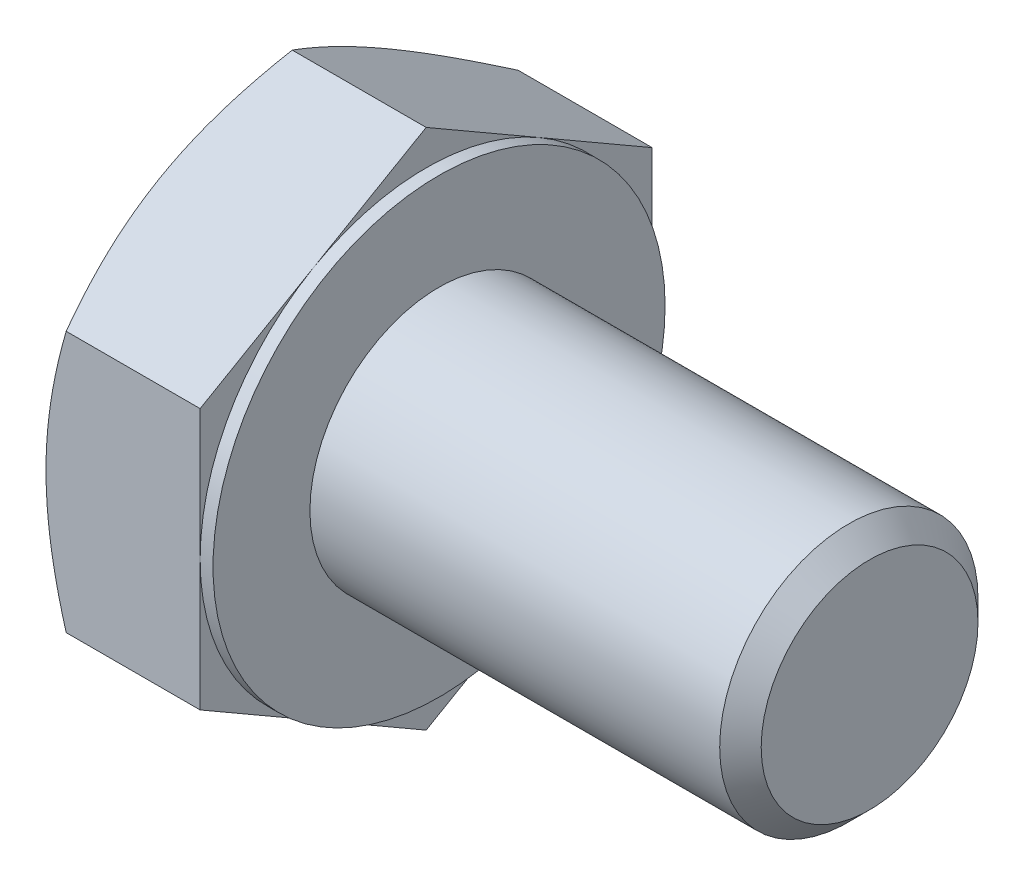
ISO-10303-21;
HEADER;
FILE_DESCRIPTION(('STEP AP214'),'2;1');
FILE_NAME('part.step','',(''),(''),'','','');
FILE_SCHEMA(('AUTOMOTIVE_DESIGN { 1 0 10303 214 1 1 1 1 }'));
ENDSEC;
DATA;
#1=APPLICATION_CONTEXT('core data for automotive mechanical design processes');
#2=APPLICATION_PROTOCOL_DEFINITION('international standard','automotive_design',2000,#1);
#3=PRODUCT_CONTEXT('',#1,'mechanical');
#4=PRODUCT('Part','Part','',(#3));
#5=PRODUCT_RELATED_PRODUCT_CATEGORY('part','',(#4));
#6=PRODUCT_DEFINITION_FORMATION('','',#4);
#7=PRODUCT_DEFINITION_CONTEXT('part definition',#1,'design');
#8=PRODUCT_DEFINITION('design','',#6,#7);
#9=PRODUCT_DEFINITION_SHAPE('','',#8);
#10=(LENGTH_UNIT() NAMED_UNIT(*) SI_UNIT(.MILLI.,.METRE.));
#11=(NAMED_UNIT(*) PLANE_ANGLE_UNIT() SI_UNIT($,.RADIAN.));
#12=(NAMED_UNIT(*) SI_UNIT($,.STERADIAN.) SOLID_ANGLE_UNIT());
#13=UNCERTAINTY_MEASURE_WITH_UNIT(LENGTH_MEASURE(1.E-05),#10,'distance_accuracy_value','');
#14=(GEOMETRIC_REPRESENTATION_CONTEXT(3) GLOBAL_UNCERTAINTY_ASSIGNED_CONTEXT((#13)) GLOBAL_UNIT_ASSIGNED_CONTEXT((#10,
#11,#12)) REPRESENTATION_CONTEXT('',''));
#15=CARTESIAN_POINT('',(0.,0.,0.));
#16=DIRECTION('',(0.,0.,1.));
#17=DIRECTION('',(1.,0.,0.));
#18=AXIS2_PLACEMENT_3D('',#15,#16,#17);
#19=CARTESIAN_POINT('',(7.76,12.1243556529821,0.));
#20=DIRECTION('',(1.,0.,0.));
#21=DIRECTION('',(0.,0.,-1.));
#22=AXIS2_PLACEMENT_3D('',#19,#20,#21);
#23=PLANE('',#22);
#24=CARTESIAN_POINT('',(7.76,0.,0.));
#25=DIRECTION('',(1.,0.,0.));
#26=DIRECTION('',(0.,0.,-1.));
#27=AXIS2_PLACEMENT_3D('',#24,#25,#26);
#28=CIRCLE('',#27,6.);
#29=CARTESIAN_POINT('',(7.76,0.,-6.));
#30=VERTEX_POINT('',#29);
#31=EDGE_CURVE('E254',#30,#30,#28,.F.);
#32=ORIENTED_EDGE('',*,*,#31,.T.);
#33=EDGE_LOOP('',(#32));
#34=FACE_BOUND('',#33,.T.);
#35=CARTESIAN_POINT('',(7.76,0.,0.));
#36=DIRECTION('',(1.,0.,0.));
#37=DIRECTION('',(0.,0.,-1.));
#38=AXIS2_PLACEMENT_3D('',#35,#36,#37);
#39=CIRCLE('',#38,10.5);
#40=CARTESIAN_POINT('',(7.76,0.,-10.5));
#41=VERTEX_POINT('',#40);
#42=EDGE_CURVE('E257',#41,#41,#39,.T.);
#43=ORIENTED_EDGE('',*,*,#42,.T.);
#44=EDGE_LOOP('',(#43));
#45=FACE_BOUND('',#44,.T.);
#46=ADVANCED_FACE('F35',(#34,#45),#23,.T.);
#47=CARTESIAN_POINT('',(0.,0.,0.));
#48=DIRECTION('',(-1.,0.,0.));
#49=DIRECTION('',(0.,0.,1.));
#50=AXIS2_PLACEMENT_3D('',#47,#48,#49);
#51=CYLINDRICAL_SURFACE('',#50,6.);
#52=ORIENTED_EDGE('',*,*,#31,.F.);
#53=EDGE_LOOP('',(#52));
#54=FACE_BOUND('',#53,.T.);
#55=CARTESIAN_POINT('',(26.796,0.,0.));
#56=DIRECTION('',(-1.,0.,0.));
#57=DIRECTION('',(0.,0.,1.));
#58=AXIS2_PLACEMENT_3D('',#55,#56,#57);
#59=CIRCLE('',#58,6.);
#60=CARTESIAN_POINT('',(26.796,0.,6.));
#61=VERTEX_POINT('',#60);
#62=EDGE_CURVE('E277',#61,#61,#59,.T.);
#63=ORIENTED_EDGE('',*,*,#62,.T.);
#64=EDGE_LOOP('',(#63));
#65=FACE_BOUND('',#64,.T.);
#66=ADVANCED_FACE('F243',(#54,#65),#51,.T.);
#67=CARTESIAN_POINT('',(27.76,0.,0.));
#68=DIRECTION('',(-1.,0.,0.));
#69=DIRECTION('',(0.,0.,1.));
#70=AXIS2_PLACEMENT_3D('',#67,#68,#69);
#71=CONICAL_SURFACE('',#70,5.036,0.785398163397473);
#72=ORIENTED_EDGE('',*,*,#62,.F.);
#73=EDGE_LOOP('',(#72));
#74=FACE_BOUND('',#73,.T.);
#75=CARTESIAN_POINT('',(27.76,0.,0.));
#76=DIRECTION('',(-1.,0.,0.));
#77=DIRECTION('',(0.,0.,1.));
#78=AXIS2_PLACEMENT_3D('',#75,#76,#77);
#79=CIRCLE('',#78,5.036);
#80=CARTESIAN_POINT('',(27.76,0.,5.036));
#81=VERTEX_POINT('',#80);
#82=EDGE_CURVE('E279',#81,#81,#79,.T.);
#83=ORIENTED_EDGE('',*,*,#82,.T.);
#84=EDGE_LOOP('',(#83));
#85=FACE_BOUND('',#84,.T.);
#86=ADVANCED_FACE('F248',(#74,#85),#71,.T.);
#87=CARTESIAN_POINT('',(27.76,0.,0.));
#88=DIRECTION('',(-1.,0.,0.));
#89=DIRECTION('',(0.,0.,1.));
#90=AXIS2_PLACEMENT_3D('',#87,#88,#89);
#91=PLANE('',#90);
#92=ORIENTED_EDGE('',*,*,#82,.F.);
#93=EDGE_LOOP('',(#92));
#94=FACE_BOUND('',#93,.T.);
#95=ADVANCED_FACE('F343',(#94),#91,.F.);
#96=CARTESIAN_POINT('',(7.16,10.5,0.));
#97=DIRECTION('',(1.,0.,0.));
#98=DIRECTION('',(0.,0.,-1.));
#99=AXIS2_PLACEMENT_3D('',#96,#97,#98);
#100=PLANE('',#99);
#101=DIRECTION('',(0.,0.500000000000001,0.866025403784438));
#102=VECTOR('',#101,1.);
#103=CARTESIAN_POINT('',(7.16,6.06217782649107,-10.5));
#104=LINE('',#103,#102);
#105=CARTESIAN_POINT('',(7.16,6.06217782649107,-10.5));
#106=VERTEX_POINT('',#105);
#107=CARTESIAN_POINT('',(7.16,9.0932667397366,-5.25000000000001));
#108=VERTEX_POINT('',#107);
#109=EDGE_CURVE('E168',#106,#108,#104,.T.);
#110=ORIENTED_EDGE('',*,*,#109,.T.);
#111=CARTESIAN_POINT('',(7.16,0.,0.));
#112=DIRECTION('',(-1.,0.,0.));
#113=DIRECTION('',(0.,0.,1.));
#114=AXIS2_PLACEMENT_3D('',#111,#112,#113);
#115=CIRCLE('',#114,10.5);
#116=CARTESIAN_POINT('',(7.16,0.,-10.5));
#117=VERTEX_POINT('',#116);
#118=EDGE_CURVE('E51',#108,#117,#115,.T.);
#119=ORIENTED_EDGE('',*,*,#118,.T.);
#120=DIRECTION('',(0.,1.,0.));
#121=VECTOR('',#120,1.);
#122=CARTESIAN_POINT('',(7.16,6.06217782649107,-10.5));
#123=LINE('',#122,#121);
#124=EDGE_CURVE('E40',#117,#106,#123,.T.);
#125=ORIENTED_EDGE('',*,*,#124,.T.);
#126=EDGE_LOOP('',(#110,#119,#125));
#127=FACE_BOUND('',#126,.T.);
#128=ADVANCED_FACE('F335',(#127),#100,.T.);
#129=CARTESIAN_POINT('',(7.16,12.1243556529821,0.));
#130=VERTEX_POINT('',#129);
#131=EDGE_CURVE('E166',#108,#130,#104,.T.);
#132=ORIENTED_EDGE('',*,*,#131,.T.);
#133=DIRECTION('',(0.,-0.500000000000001,0.866025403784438));
#134=VECTOR('',#133,1.);
#135=CARTESIAN_POINT('',(7.16,12.1243556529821,0.));
#136=LINE('',#135,#134);
#137=CARTESIAN_POINT('',(7.16,9.0932667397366,5.25000000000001));
#138=VERTEX_POINT('',#137);
#139=EDGE_CURVE('E165',#130,#138,#136,.T.);
#140=ORIENTED_EDGE('',*,*,#139,.T.);
#141=EDGE_CURVE('E154',#138,#108,#115,.T.);
#142=ORIENTED_EDGE('',*,*,#141,.T.);
#143=EDGE_LOOP('',(#132,#140,#142));
#144=FACE_BOUND('',#143,.T.);
#145=ADVANCED_FACE('F337',(#144),#100,.T.);
#146=CARTESIAN_POINT('',(7.16,6.06217782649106,10.5));
#147=VERTEX_POINT('',#146);
#148=EDGE_CURVE('E133',#138,#147,#136,.T.);
#149=ORIENTED_EDGE('',*,*,#148,.T.);
#150=DIRECTION('',(0.,-1.,0.));
#151=VECTOR('',#150,1.);
#152=CARTESIAN_POINT('',(7.16,6.06217782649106,10.5));
#153=LINE('',#152,#151);
#154=CARTESIAN_POINT('',(7.16,0.,10.5));
#155=VERTEX_POINT('',#154);
#156=EDGE_CURVE('E127',#147,#155,#153,.T.);
#157=ORIENTED_EDGE('',*,*,#156,.T.);
#158=EDGE_CURVE('E131',#155,#138,#115,.T.);
#159=ORIENTED_EDGE('',*,*,#158,.T.);
#160=EDGE_LOOP('',(#149,#157,#159));
#161=FACE_BOUND('',#160,.T.);
#162=ADVANCED_FACE('F129',(#161),#100,.T.);
#163=CARTESIAN_POINT('',(7.16,-6.06217782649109,10.5));
#164=VERTEX_POINT('',#163);
#165=EDGE_CURVE('E137',#155,#164,#153,.T.);
#166=ORIENTED_EDGE('',*,*,#165,.T.);
#167=DIRECTION('',(0.,-0.500000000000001,-0.866025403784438));
#168=VECTOR('',#167,1.);
#169=CARTESIAN_POINT('',(7.16,-12.1243556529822,0.));
#170=LINE('',#169,#168);
#171=CARTESIAN_POINT('',(7.16,-9.0932667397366,5.25000000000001));
#172=VERTEX_POINT('',#171);
#173=EDGE_CURVE('E144',#164,#172,#170,.T.);
#174=ORIENTED_EDGE('',*,*,#173,.T.);
#175=EDGE_CURVE('E141',#172,#155,#115,.T.);
#176=ORIENTED_EDGE('',*,*,#175,.T.);
#177=EDGE_LOOP('',(#166,#174,#176));
#178=FACE_BOUND('',#177,.T.);
#179=ADVANCED_FACE('F142',(#178),#100,.T.);
#180=CARTESIAN_POINT('',(7.16,-12.1243556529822,0.));
#181=VERTEX_POINT('',#180);
#182=EDGE_CURVE('E160',#172,#181,#170,.T.);
#183=ORIENTED_EDGE('',*,*,#182,.T.);
#184=DIRECTION('',(0.,0.500000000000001,-0.866025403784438));
#185=VECTOR('',#184,1.);
#186=CARTESIAN_POINT('',(7.16,-6.06217782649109,-10.5));
#187=LINE('',#186,#185);
#188=CARTESIAN_POINT('',(7.16,-9.0932667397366,-5.25000000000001));
#189=VERTEX_POINT('',#188);
#190=EDGE_CURVE('E329',#181,#189,#187,.T.);
#191=ORIENTED_EDGE('',*,*,#190,.T.);
#192=EDGE_CURVE('E148',#189,#172,#115,.T.);
#193=ORIENTED_EDGE('',*,*,#192,.T.);
#194=EDGE_LOOP('',(#183,#191,#193));
#195=FACE_BOUND('',#194,.T.);
#196=ADVANCED_FACE('F350',(#195),#100,.T.);
#197=CARTESIAN_POINT('',(7.16,-6.06217782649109,-10.5));
#198=VERTEX_POINT('',#197);
#199=EDGE_CURVE('E155',#189,#198,#187,.T.);
#200=ORIENTED_EDGE('',*,*,#199,.T.);
#201=EDGE_CURVE('E11',#198,#117,#123,.T.);
#202=ORIENTED_EDGE('',*,*,#201,.T.);
#203=EDGE_CURVE('E334',#117,#189,#115,.T.);
#204=ORIENTED_EDGE('',*,*,#203,.T.);
#205=EDGE_LOOP('',(#200,#202,#204));
#206=FACE_BOUND('',#205,.T.);
#207=ADVANCED_FACE('F332',(#206),#100,.T.);
#208=CARTESIAN_POINT('',(0.,0.,0.));
#209=DIRECTION('',(-1.,0.,0.));
#210=DIRECTION('',(0.,0.,1.));
#211=AXIS2_PLACEMENT_3D('',#208,#209,#210);
#212=CYLINDRICAL_SURFACE('',#211,10.5);
#213=ORIENTED_EDGE('',*,*,#118,.F.);
#214=ORIENTED_EDGE('',*,*,#141,.F.);
#215=ORIENTED_EDGE('',*,*,#158,.F.);
#216=ORIENTED_EDGE('',*,*,#175,.F.);
#217=ORIENTED_EDGE('',*,*,#192,.F.);
#218=ORIENTED_EDGE('',*,*,#203,.F.);
#219=EDGE_LOOP('',(#213,#214,#215,#216,#217,#218));
#220=FACE_BOUND('',#219,.T.);
#221=ORIENTED_EDGE('',*,*,#42,.F.);
#222=EDGE_LOOP('',(#221));
#223=FACE_BOUND('',#222,.T.);
#224=ADVANCED_FACE('F151',(#220,#223),#212,.T.);
#225=CARTESIAN_POINT('',(0.,12.1243556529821,0.));
#226=DIRECTION('',(1.,0.,0.));
#227=DIRECTION('',(0.,0.,-1.));
#228=AXIS2_PLACEMENT_3D('',#225,#226,#227);
#229=PLANE('',#228);
#230=CARTESIAN_POINT('',(0.,0.,0.));
#231=DIRECTION('',(1.,0.,0.));
#232=DIRECTION('',(0.,0.,-1.));
#233=AXIS2_PLACEMENT_3D('',#230,#231,#232);
#234=CIRCLE('',#233,10.5);
#235=CARTESIAN_POINT('',(0.,0.,-10.5));
#236=VERTEX_POINT('',#235);
#237=CARTESIAN_POINT('',(0.,9.0932667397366,-5.25000000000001));
#238=VERTEX_POINT('',#237);
#239=EDGE_CURVE('E258',#236,#238,#234,.T.);
#240=ORIENTED_EDGE('',*,*,#239,.F.);
#241=CARTESIAN_POINT('',(0.,-9.0932667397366,-5.25000000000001));
#242=VERTEX_POINT('',#241);
#243=EDGE_CURVE('E261',#242,#236,#234,.T.);
#244=ORIENTED_EDGE('',*,*,#243,.F.);
#245=CARTESIAN_POINT('',(0.,-9.0932667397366,5.25000000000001));
#246=VERTEX_POINT('',#245);
#247=EDGE_CURVE('E264',#246,#242,#234,.T.);
#248=ORIENTED_EDGE('',*,*,#247,.F.);
#249=CARTESIAN_POINT('',(0.,0.,10.5));
#250=VERTEX_POINT('',#249);
#251=EDGE_CURVE('E300',#250,#246,#234,.T.);
#252=ORIENTED_EDGE('',*,*,#251,.F.);
#253=CARTESIAN_POINT('',(0.,0.,0.));
#254=DIRECTION('',(-1.,0.,0.));
#255=DIRECTION('',(0.,0.,1.));
#256=AXIS2_PLACEMENT_3D('',#253,#254,#255);
#257=CIRCLE('',#256,10.5);
#258=CARTESIAN_POINT('',(0.,9.0932667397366,5.25000000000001));
#259=VERTEX_POINT('',#258);
#260=EDGE_CURVE('E169',#250,#259,#257,.T.);
#261=ORIENTED_EDGE('',*,*,#260,.T.);
#262=EDGE_CURVE('E259',#238,#259,#234,.T.);
#263=ORIENTED_EDGE('',*,*,#262,.F.);
#264=EDGE_LOOP('',(#240,#244,#248,#252,#261,#263));
#265=FACE_BOUND('',#264,.T.);
#266=ADVANCED_FACE('F301',(#265),#229,.F.);
#267=CARTESIAN_POINT('',(0.,0.,0.));
#268=DIRECTION('',(1.,0.,0.));
#269=DIRECTION('',(0.,0.,-1.));
#270=AXIS2_PLACEMENT_3D('',#267,#268,#269);
#271=CONICAL_SURFACE('',#270,10.5,1.0471975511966);
#272=CARTESIAN_POINT('',(0.937888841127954,6.06206235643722,10.5002));
#273=CARTESIAN_POINT('',(0.860963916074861,6.19532217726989,10.2693872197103));
#274=CARTESIAN_POINT('',(0.787530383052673,6.32907886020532,10.0377138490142));
#275=CARTESIAN_POINT('',(0.648614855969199,6.5976648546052,9.57250926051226));
#276=CARTESIAN_POINT('',(0.583135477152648,6.7324945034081,9.33897745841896));
#277=CARTESIAN_POINT('',(0.399895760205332,7.13915595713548,8.63461915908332));
#278=CARTESIAN_POINT('',(0.295669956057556,7.41259311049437,8.16101211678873));
#279=CARTESIAN_POINT('',(0.173455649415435,7.82177929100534,7.45228086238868));
#280=CARTESIAN_POINT('',(0.138641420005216,7.95630585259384,7.21927402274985));
#281=CARTESIAN_POINT('',(0.0802602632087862,8.22598182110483,6.75218154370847));
#282=CARTESIAN_POINT('',(0.0566935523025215,8.36113123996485,6.51809588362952));
#283=CARTESIAN_POINT('',(0.0214112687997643,8.63165551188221,6.04953409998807));
#284=CARTESIAN_POINT('',(0.00968161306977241,8.76702990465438,5.81505877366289));
#285=CARTESIAN_POINT('',(-0.00167731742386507,9.03790372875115,5.34589154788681));
#286=CARTESIAN_POINT('',(-0.00130696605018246,9.17340315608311,5.11119965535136));
#287=CARTESIAN_POINT('',(0.0106922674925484,9.42672188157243,4.67243875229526));
#288=CARTESIAN_POINT('',(0.0208573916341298,9.54455906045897,4.4683387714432));
#289=CARTESIAN_POINT('',(0.0501416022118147,9.77995782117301,4.06061615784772));
#290=CARTESIAN_POINT('',(0.0692613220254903,9.89751938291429,3.85699355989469));
#291=CARTESIAN_POINT('',(0.139600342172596,10.2497485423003,3.24691475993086));
#292=CARTESIAN_POINT('',(0.203790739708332,10.4837926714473,2.84153843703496));
#293=CARTESIAN_POINT('',(0.364267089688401,10.9543635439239,2.02648577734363));
#294=CARTESIAN_POINT('',(0.461233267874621,11.1908302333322,1.61691345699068));
#295=CARTESIAN_POINT('',(0.681306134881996,11.6602373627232,0.80387645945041));
#296=CARTESIAN_POINT('',(0.804361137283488,11.8931838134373,0.40040137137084));
#297=CARTESIAN_POINT('',(0.937888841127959,12.124471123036,-0.000199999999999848));
#298=B_SPLINE_CURVE_WITH_KNOTS('',3,(#272,#273,#274,#275,#276,#277,#278,#279,#280,#281,#282,
#283,#284,#285,#286,#287,#288,#289,#290,#291,#292,#293,#294,#295,#296,#297),.UNSPECIFIED.,.F.,
.F.,(4,2,2,2,2,2,2,2,2,2,2,2,4),(0.,0.832130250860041,1.66453336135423,3.33288308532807,
4.14658222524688,4.9602970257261,5.77304256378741,6.5857629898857,7.29326708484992,
8.00082123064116,9.41693497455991,10.864454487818,12.3091325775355),.UNSPECIFIED.);
#299=CARTESIAN_POINT('',(0.93782217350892,12.1243556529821,0.));
#300=VERTEX_POINT('',#299);
#301=EDGE_CURVE('E215',#259,#300,#298,.T.);
#302=ORIENTED_EDGE('',*,*,#301,.T.);
#303=CARTESIAN_POINT('',(0.93788884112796,12.124471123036,0.0002));
#304=CARTESIAN_POINT('',(0.860963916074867,11.9912113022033,-0.230612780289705));
#305=CARTESIAN_POINT('',(0.787530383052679,11.8574546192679,-0.462286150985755));
#306=CARTESIAN_POINT('',(0.648614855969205,11.588868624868,-0.927490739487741));
#307=CARTESIAN_POINT('',(0.583135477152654,11.4540389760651,-1.16102254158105));
#308=CARTESIAN_POINT('',(0.399895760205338,11.0473775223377,-1.86538084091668));
#309=CARTESIAN_POINT('',(0.295669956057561,10.7739403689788,-2.33898788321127));
#310=CARTESIAN_POINT('',(0.173455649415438,10.3647541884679,-3.04771913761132));
#311=CARTESIAN_POINT('',(0.138641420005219,10.2302276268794,-3.28072597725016));
#312=CARTESIAN_POINT('',(0.0802602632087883,9.96055165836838,-3.74781845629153));
#313=CARTESIAN_POINT('',(0.0566935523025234,9.82540223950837,-3.98190411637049));
#314=CARTESIAN_POINT('',(0.0214112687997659,9.554877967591,-4.45046590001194));
#315=CARTESIAN_POINT('',(0.00968161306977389,9.41950357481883,-4.68494122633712));
#316=CARTESIAN_POINT('',(-0.00167731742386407,9.14862975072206,-5.1541084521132));
#317=CARTESIAN_POINT('',(-0.00130696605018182,9.0131303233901,-5.38880034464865));
#318=CARTESIAN_POINT('',(0.0106922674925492,8.75981159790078,-5.82756124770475));
#319=CARTESIAN_POINT('',(0.0208573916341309,8.64197441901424,-6.03166122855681));
#320=CARTESIAN_POINT('',(0.0501416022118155,8.4065756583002,-6.43938384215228));
#321=CARTESIAN_POINT('',(0.0692613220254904,8.28901409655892,-6.64300644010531));
#322=CARTESIAN_POINT('',(0.139600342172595,7.93678493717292,-7.25308524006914));
#323=CARTESIAN_POINT('',(0.20379073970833,7.70274080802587,-7.65846156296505));
#324=CARTESIAN_POINT('',(0.364267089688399,7.23216993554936,-8.47351422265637));
#325=CARTESIAN_POINT('',(0.461233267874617,6.99570324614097,-8.88308654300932));
#326=CARTESIAN_POINT('',(0.681306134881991,6.52629611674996,-9.69612354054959));
#327=CARTESIAN_POINT('',(0.804361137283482,6.29334966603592,-10.0995986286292));
#328=CARTESIAN_POINT('',(0.937888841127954,6.06206235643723,-10.5002));
#329=B_SPLINE_CURVE_WITH_KNOTS('',3,(#303,#304,#305,#306,#307,#308,#309,#310,#311,#312,#313,
#314,#315,#316,#317,#318,#319,#320,#321,#322,#323,#324,#325,#326,#327,#328),.UNSPECIFIED.,.F.,
.F.,(4,2,2,2,2,2,2,2,2,2,2,2,4),(0.,0.83213025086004,1.66453336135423,3.33288308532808,
4.14658222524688,4.9602970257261,5.77304256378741,6.58576298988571,7.29326708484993,
8.00082123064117,9.41693497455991,10.864454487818,12.3091325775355),.UNSPECIFIED.);
#330=EDGE_CURVE('E59',#300,#238,#329,.T.);
#331=ORIENTED_EDGE('',*,*,#330,.T.);
#332=ORIENTED_EDGE('',*,*,#262,.T.);
#333=EDGE_LOOP('',(#302,#331,#332));
#334=FACE_BOUND('',#333,.T.);
#335=ADVANCED_FACE('F297',(#334),#271,.T.);
#336=CARTESIAN_POINT('',(5.22047445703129,-16.4816482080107,10.5));
#337=CARTESIAN_POINT('',(5.10841570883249,-16.2515114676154,10.5));
#338=CARTESIAN_POINT('',(4.99690095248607,-16.0211099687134,10.5));
#339=CARTESIAN_POINT('',(4.77508224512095,-15.5597222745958,10.5));
#340=CARTESIAN_POINT('',(4.66477830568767,-15.3287360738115,10.5));
#341=CARTESIAN_POINT('',(4.33583913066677,-14.6347588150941,10.5));
#342=CARTESIAN_POINT('',(4.11920831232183,-14.170814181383,10.5));
#343=CARTESIAN_POINT('',(3.69144021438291,-13.23745423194,10.5));
#344=CARTESIAN_POINT('',(3.48033759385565,-12.768022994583,10.5));
#345=CARTESIAN_POINT('',(3.06650722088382,-11.8254960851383,10.5));
#346=CARTESIAN_POINT('',(2.86377908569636,-11.3524005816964,10.5));
#347=CARTESIAN_POINT('',(2.46224554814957,-10.3857558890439,10.5));
#348=CARTESIAN_POINT('',(2.26380321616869,-9.8920551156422,10.5));
#349=CARTESIAN_POINT('',(1.88146297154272,-8.89894763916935,10.5));
#350=CARTESIAN_POINT('',(1.69756666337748,-8.39954031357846,10.5));
#351=CARTESIAN_POINT('',(1.34900485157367,-7.39511365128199,10.5));
#352=CARTESIAN_POINT('',(1.1843020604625,-6.89010735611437,10.5));
#353=CARTESIAN_POINT('',(0.87927089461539,-5.87280589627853,10.5));
#354=CARTESIAN_POINT('',(0.738935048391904,-5.3605130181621,10.5));
#355=CARTESIAN_POINT('',(0.552073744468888,-4.58793726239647,10.5));
#356=CARTESIAN_POINT('',(0.49386024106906,-4.33046551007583,10.5));
#357=CARTESIAN_POINT('',(0.385986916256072,-3.81372703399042,10.5));
#358=CARTESIAN_POINT('',(0.336326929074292,-3.55446034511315,10.5));
#359=CARTESIAN_POINT('',(0.246424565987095,-3.03429646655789,10.5));
#360=CARTESIAN_POINT('',(0.206181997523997,-2.77339931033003,10.5));
#361=CARTESIAN_POINT('',(0.135909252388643,-2.25023434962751,10.5));
#362=CARTESIAN_POINT('',(0.105878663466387,-1.98796660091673,10.5));
#363=CARTESIAN_POINT('',(0.0570143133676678,-1.46593685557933,10.5));
#364=CARTESIAN_POINT('',(0.0380355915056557,-1.20618851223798,10.5));
#365=CARTESIAN_POINT('',(0.0110886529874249,-0.686121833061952,10.5));
#366=CARTESIAN_POINT('',(0.00312024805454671,-0.425803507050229,10.5));
#367=CARTESIAN_POINT('',(-0.00161548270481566,0.0949369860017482,10.5));
#368=CARTESIAN_POINT('',(0.00161717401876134,0.355359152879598,10.5));
#369=CARTESIAN_POINT('',(0.0192021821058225,0.875830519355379,10.5));
#370=CARTESIAN_POINT('',(0.033555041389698,1.13587970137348,10.5));
#371=CARTESIAN_POINT('',(0.0806524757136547,1.75496707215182,10.5));
#372=CARTESIAN_POINT('',(0.118345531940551,2.11363730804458,10.5));
#373=CARTESIAN_POINT('',(0.212873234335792,2.82842727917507,10.5));
#374=CARTESIAN_POINT('',(0.269710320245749,3.18454668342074,10.5));
#375=CARTESIAN_POINT('',(0.465933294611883,4.24861013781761,10.5));
#376=CARTESIAN_POINT('',(0.630998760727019,4.95188759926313,10.5));
#377=CARTESIAN_POINT('',(0.918660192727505,6.00372345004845,10.5));
#378=CARTESIAN_POINT('',(1.02259898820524,6.35769943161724,10.5));
#379=CARTESIAN_POINT('',(1.24163072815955,7.06221736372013,10.5));
#380=CARTESIAN_POINT('',(1.35672375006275,7.41275929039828,10.5));
#381=CARTESIAN_POINT('',(1.59618779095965,8.11051221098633,10.5));
#382=CARTESIAN_POINT('',(1.72055601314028,8.45772417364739,10.5));
#383=CARTESIAN_POINT('',(1.97707155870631,9.14924772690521,10.5));
#384=CARTESIAN_POINT('',(2.1092187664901,9.49355936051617,10.5));
#385=CARTESIAN_POINT('',(2.44296998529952,10.3391183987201,10.5));
#386=CARTESIAN_POINT('',(2.64829832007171,10.8388934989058,10.5));
#387=CARTESIAN_POINT('',(3.06975629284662,11.8338833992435,10.5));
#388=CARTESIAN_POINT('',(3.2858867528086,12.3290978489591,10.5));
#389=CARTESIAN_POINT('',(3.72667155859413,13.3158710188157,10.5));
#390=CARTESIAN_POINT('',(3.95132823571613,13.8074286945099,10.5));
#391=CARTESIAN_POINT('',(4.40735039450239,14.7873974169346,10.5));
#392=CARTESIAN_POINT('',(4.63871569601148,15.2758085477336,10.5));
#393=CARTESIAN_POINT('',(5.10713603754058,16.2506551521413,10.5));
#394=CARTESIAN_POINT('',(5.3441979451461,16.7370873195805,10.5));
#395=CARTESIAN_POINT('',(5.82271335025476,17.7077867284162,10.5));
#396=CARTESIAN_POINT('',(6.06416687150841,18.1920539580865,10.5));
#397=CARTESIAN_POINT('',(6.55064005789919,19.1586956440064,10.5));
#398=CARTESIAN_POINT('',(6.79565915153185,19.6410703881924,10.5));
#399=CARTESIAN_POINT('',(7.28869162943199,20.6042880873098,10.5));
#400=CARTESIAN_POINT('',(7.53670502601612,21.0851310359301,10.5));
#401=CARTESIAN_POINT('',(8.23932372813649,22.4387066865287,10.5));
#402=CARTESIAN_POINT('',(8.69680932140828,23.3099441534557,10.5));
#403=CARTESIAN_POINT('',(9.61789414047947,25.0492220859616,10.5));
#404=CARTESIAN_POINT('',(10.0814936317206,25.9172624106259,10.5));
#405=CARTESIAN_POINT('',(11.0120158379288,27.6483953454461,10.5));
#406=CARTESIAN_POINT('',(11.4789254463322,28.5114950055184,10.5));
#407=CARTESIAN_POINT('',(12.1819662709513,29.8046525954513,10.5));
#408=CARTESIAN_POINT('',(12.4167519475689,30.2354431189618,10.5));
#409=CARTESIAN_POINT('',(12.8871248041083,31.0965855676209,10.5));
#410=CARTESIAN_POINT('',(13.1227119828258,31.5269374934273,10.5));
#411=CARTESIAN_POINT('',(13.3586525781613,31.9570956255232,10.5));
#412=B_SPLINE_CURVE_WITH_KNOTS('',3,(#336,#337,#338,#339,#340,#341,#342,#343,#344,#345,#346,
#347,#348,#349,#350,#351,#352,#353,#354,#355,#356,#357,#358,#359,#360,#361,#362,#363,#364,#365,
#366,#367,#368,#369,#370,#371,#372,#373,#374,#375,#376,#377,#378,#379,#380,#381,#382,#383,#384,
#385,#386,#387,#388,#389,#390,#391,#392,#393,#394,#395,#396,#397,#398,#399,#400,#401,#402,#403,
#404,#405,#406,#407,#408,#409,#410,#411),.UNSPECIFIED.,.F.,.F.,(4,2,2,2,2,2,2,2,2,2,2,2,2,2,2,2,
2,2,2,2,2,2,2,2,2,2,2,2,2,2,2,2,2,2,2,2,2,4),(0.,0.767905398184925,1.53581813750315,
3.07186087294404,4.61593758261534,6.15994364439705,7.756038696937,9.35230955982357,
10.9454257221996,12.5380525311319,13.3298454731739,14.1216230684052,14.9133844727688,
15.7051139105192,16.4862101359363,17.2672930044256,18.04837465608,18.8294919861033,
19.9108211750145,20.9922882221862,23.1563369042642,24.2630005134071,25.3696718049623,
26.4760107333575,27.5823332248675,29.2030865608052,30.8239634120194,32.4452866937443,
34.0665664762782,35.6899099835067,37.3132622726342,38.936357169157,40.5594587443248,
43.5115615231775,46.4637928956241,49.407674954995,50.879524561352,52.3513719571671),.UNSPECIFIED.);
#413=CARTESIAN_POINT('',(0.937822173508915,6.06217782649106,10.5));
#414=VERTEX_POINT('',#413);
#415=EDGE_CURVE('E227',#250,#414,#412,.T.);
#416=ORIENTED_EDGE('',*,*,#415,.T.);
#417=EDGE_CURVE('E226',#414,#259,#298,.T.);
#418=ORIENTED_EDGE('',*,*,#417,.T.);
#419=ORIENTED_EDGE('',*,*,#260,.F.);
#420=EDGE_LOOP('',(#416,#418,#419));
#421=FACE_BOUND('',#420,.T.);
#422=ADVANCED_FACE('F293',(#421),#271,.T.);
#423=CARTESIAN_POINT('',(0.937822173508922,-6.06217782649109,10.5));
#424=VERTEX_POINT('',#423);
#425=EDGE_CURVE('E281',#424,#250,#412,.T.);
#426=ORIENTED_EDGE('',*,*,#425,.T.);
#427=ORIENTED_EDGE('',*,*,#251,.T.);
#428=CARTESIAN_POINT('',(0.937888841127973,-12.124471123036,-0.000199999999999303));
#429=CARTESIAN_POINT('',(0.860963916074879,-11.9912113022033,0.230612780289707));
#430=CARTESIAN_POINT('',(0.787530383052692,-11.8574546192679,0.462286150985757));
#431=CARTESIAN_POINT('',(0.648614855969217,-11.588868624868,0.927490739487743));
#432=CARTESIAN_POINT('',(0.583135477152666,-11.4540389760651,1.16102254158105));
#433=CARTESIAN_POINT('',(0.399895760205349,-11.0473775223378,1.86538084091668));
#434=CARTESIAN_POINT('',(0.295669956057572,-10.7739403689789,2.33898788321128));
#435=CARTESIAN_POINT('',(0.173455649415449,-10.3647541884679,3.04771913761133));
#436=CARTESIAN_POINT('',(0.13864142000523,-10.2302276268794,3.28072597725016));
#437=CARTESIAN_POINT('',(0.0802602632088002,-9.9605516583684,3.74781845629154));
#438=CARTESIAN_POINT('',(0.0566935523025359,-9.82540223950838,3.9819041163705));
#439=CARTESIAN_POINT('',(0.0214112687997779,-9.55487796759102,4.45046590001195));
#440=CARTESIAN_POINT('',(0.0096816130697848,-9.41950357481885,4.68494122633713));
#441=CARTESIAN_POINT('',(-0.00167731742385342,-9.14862975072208,5.15410845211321));
#442=CARTESIAN_POINT('',(-0.00130696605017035,-9.01313032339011,5.38880034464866));
#443=CARTESIAN_POINT('',(0.0106922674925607,-8.75981159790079,5.82756124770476));
#444=CARTESIAN_POINT('',(0.0208573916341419,-8.64197441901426,6.03166122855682));
#445=CARTESIAN_POINT('',(0.0501416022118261,-8.40657565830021,6.43938384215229));
#446=CARTESIAN_POINT('',(0.0692613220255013,-8.28901409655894,6.64300644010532));
#447=CARTESIAN_POINT('',(0.139600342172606,-7.93678493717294,7.25308524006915));
#448=CARTESIAN_POINT('',(0.203790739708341,-7.70274080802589,7.65846156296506));
#449=CARTESIAN_POINT('',(0.364267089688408,-7.23216993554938,8.47351422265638));
#450=CARTESIAN_POINT('',(0.461233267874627,-6.99570324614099,8.88308654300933));
#451=CARTESIAN_POINT('',(0.681306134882,-6.52629611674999,9.69612354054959));
#452=CARTESIAN_POINT('',(0.804361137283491,-6.29334966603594,10.0995986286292));
#453=CARTESIAN_POINT('',(0.937888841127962,-6.06206235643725,10.5002));
#454=B_SPLINE_CURVE_WITH_KNOTS('',3,(#428,#429,#430,#431,#432,#433,#434,#435,#436,#437,#438,
#439,#440,#441,#442,#443,#444,#445,#446,#447,#448,#449,#450,#451,#452,#453),.UNSPECIFIED.,.F.,
.F.,(4,2,2,2,2,2,2,2,2,2,2,2,4),(0.,0.832130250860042,1.66453336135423,3.33288308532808,
4.14658222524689,4.96029702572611,5.77304256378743,6.58576298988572,7.29326708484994,
8.00082123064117,9.41693497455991,10.864454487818,12.3091325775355),.UNSPECIFIED.);
#455=EDGE_CURVE('E217',#246,#424,#454,.T.);
#456=ORIENTED_EDGE('',*,*,#455,.T.);
#457=EDGE_LOOP('',(#426,#427,#456));
#458=FACE_BOUND('',#457,.T.);
#459=ADVANCED_FACE('F187',(#458),#271,.T.);
#460=CARTESIAN_POINT('',(0.937822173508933,-12.1243556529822,0.));
#461=VERTEX_POINT('',#460);
#462=EDGE_CURVE('E210',#461,#246,#454,.T.);
#463=ORIENTED_EDGE('',*,*,#462,.T.);
#464=ORIENTED_EDGE('',*,*,#247,.T.);
#465=CARTESIAN_POINT('',(0.937888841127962,-6.06206235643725,-10.5002));
#466=CARTESIAN_POINT('',(0.860963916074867,-6.19532217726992,-10.2693872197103));
#467=CARTESIAN_POINT('',(0.78753038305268,-6.32907886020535,-10.0377138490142));
#468=CARTESIAN_POINT('',(0.648614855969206,-6.59766485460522,-9.57250926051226));
#469=CARTESIAN_POINT('',(0.583135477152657,-6.73249450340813,-9.33897745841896));
#470=CARTESIAN_POINT('',(0.399895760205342,-7.13915595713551,-8.63461915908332));
#471=CARTESIAN_POINT('',(0.295669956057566,-7.41259311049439,-8.16101211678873));
#472=CARTESIAN_POINT('',(0.173455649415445,-7.82177929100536,-7.45228086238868));
#473=CARTESIAN_POINT('',(0.138641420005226,-7.95630585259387,-7.21927402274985));
#474=CARTESIAN_POINT('',(0.0802602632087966,-8.22598182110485,-6.75218154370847));
#475=CARTESIAN_POINT('',(0.0566935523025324,-8.36113123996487,-6.51809588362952));
#476=CARTESIAN_POINT('',(0.0214112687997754,-8.63165551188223,-6.04953409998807));
#477=CARTESIAN_POINT('',(0.00968161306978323,-8.7670299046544,-5.81505877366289));
#478=CARTESIAN_POINT('',(-0.00167731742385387,-9.03790372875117,-5.3458915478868));
#479=CARTESIAN_POINT('',(-0.00130696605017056,-9.17340315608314,-5.11119965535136));
#480=CARTESIAN_POINT('',(0.0106922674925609,-9.42672188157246,-4.67243875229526));
#481=CARTESIAN_POINT('',(0.0208573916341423,-9.544559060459,-4.46833877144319));
#482=CARTESIAN_POINT('',(0.0501416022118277,-9.77995782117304,-4.06061615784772));
#483=CARTESIAN_POINT('',(0.0692613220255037,-9.89751938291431,-3.85699355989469));
#484=CARTESIAN_POINT('',(0.13960034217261,-10.2497485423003,-3.24691475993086));
#485=CARTESIAN_POINT('',(0.203790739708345,-10.4837926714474,-2.84153843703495));
#486=CARTESIAN_POINT('',(0.364267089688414,-10.9543635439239,-2.02648577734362));
#487=CARTESIAN_POINT('',(0.461233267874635,-11.1908302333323,-1.61691345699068));
#488=CARTESIAN_POINT('',(0.68130613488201,-11.6602373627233,-0.803876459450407));
#489=CARTESIAN_POINT('',(0.804361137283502,-11.8931838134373,-0.400401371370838));
#490=CARTESIAN_POINT('',(0.937888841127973,-12.124471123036,0.000200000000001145));
#491=B_SPLINE_CURVE_WITH_KNOTS('',3,(#465,#466,#467,#468,#469,#470,#471,#472,#473,#474,#475,
#476,#477,#478,#479,#480,#481,#482,#483,#484,#485,#486,#487,#488,#489,#490),.UNSPECIFIED.,.F.,
.F.,(4,2,2,2,2,2,2,2,2,2,2,2,4),(0.,0.832130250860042,1.66453336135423,3.33288308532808,
4.14658222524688,4.9602970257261,5.77304256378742,6.58576298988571,7.29326708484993,
8.00082123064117,9.41693497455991,10.864454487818,12.3091325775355),.UNSPECIFIED.);
#492=EDGE_CURVE('E216',#242,#461,#491,.T.);
#493=ORIENTED_EDGE('',*,*,#492,.T.);
#494=EDGE_LOOP('',(#463,#464,#493));
#495=FACE_BOUND('',#494,.T.);
#496=ADVANCED_FACE('F326',(#495),#271,.T.);
#497=CARTESIAN_POINT('',(0.937822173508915,6.06217782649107,-10.5));
#498=VERTEX_POINT('',#497);
#499=EDGE_CURVE('E218',#238,#498,#329,.T.);
#500=ORIENTED_EDGE('',*,*,#499,.T.);
#501=CARTESIAN_POINT('',(5.22047445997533,-16.4816482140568,-10.5));
#502=CARTESIAN_POINT('',(5.10841571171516,-16.2515114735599,-10.5));
#503=CARTESIAN_POINT('',(4.99690095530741,-16.0211099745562,-10.5));
#504=CARTESIAN_POINT('',(4.7750822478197,-15.559722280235,-10.5));
#505=CARTESIAN_POINT('',(4.66477830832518,-15.3287360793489,-10.5));
#506=CARTESIAN_POINT('',(4.33583913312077,-14.6347588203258,-10.5));
#507=CARTESIAN_POINT('',(4.11920831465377,-14.1708141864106,-10.5));
#508=CARTESIAN_POINT('',(3.69144021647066,-13.2374542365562,-10.5));
#509=CARTESIAN_POINT('',(3.48033759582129,-12.768022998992,-10.5));
#510=CARTESIAN_POINT('',(3.06650722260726,-11.8254960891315,-10.5));
#511=CARTESIAN_POINT('',(2.8637790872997,-11.3524005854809,-10.5));
#512=CARTESIAN_POINT('',(2.46224554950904,-10.3857558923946,-10.5));
#513=CARTESIAN_POINT('',(2.26380321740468,-9.89205511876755,-10.5));
#514=CARTESIAN_POINT('',(1.8814629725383,-8.89894764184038,-10.5));
#515=CARTESIAN_POINT('',(1.69756666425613,-8.39954031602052,-10.5));
#516=CARTESIAN_POINT('',(1.34900485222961,-7.39511365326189,-10.5));
#517=CARTESIAN_POINT('',(1.18430206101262,-6.8901073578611,-10.5));
#518=CARTESIAN_POINT('',(0.879270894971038,-5.87280589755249,-10.5));
#519=CARTESIAN_POINT('',(0.738935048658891,-5.36051301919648,-10.5));
#520=CARTESIAN_POINT('',(0.552073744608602,-4.58793726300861,-10.5));
#521=CARTESIAN_POINT('',(0.493860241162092,-4.33046551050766,-10.5));
#522=CARTESIAN_POINT('',(0.385986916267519,-3.81372703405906,-10.5));
#523=CARTESIAN_POINT('',(0.336326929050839,-3.55446034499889,-10.5));
#524=CARTESIAN_POINT('',(0.246424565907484,-3.03429646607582,-10.5));
#525=CARTESIAN_POINT('',(0.20618199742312,-2.77339930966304,-10.5));
#526=CARTESIAN_POINT('',(0.135909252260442,-2.25023434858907,-10.5));
#527=CARTESIAN_POINT('',(0.105878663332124,-1.98796659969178,-10.5));
#528=CARTESIAN_POINT('',(0.0570143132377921,-1.46593685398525,-10.5));
#529=CARTESIAN_POINT('',(0.0380355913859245,-1.20618851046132,-10.5));
#530=CARTESIAN_POINT('',(0.0110886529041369,-0.686121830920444,-10.5));
#531=CARTESIAN_POINT('',(0.00312024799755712,-0.425803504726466,-10.5));
#532=CARTESIAN_POINT('',(-0.00161548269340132,0.0949369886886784,-10.5));
#533=CARTESIAN_POINT('',(0.00161717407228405,0.355359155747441,-10.5));
#534=CARTESIAN_POINT('',(0.0192021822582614,0.875830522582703,-10.5));
#535=CARTESIAN_POINT('',(0.0335550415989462,1.13587970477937,-10.5));
#536=CARTESIAN_POINT('',(0.080652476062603,1.75496707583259,-10.5));
#537=CARTESIAN_POINT('',(0.118345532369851,2.11363731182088,-10.5));
#538=CARTESIAN_POINT('',(0.212873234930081,2.82842728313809,-10.5));
#539=CARTESIAN_POINT('',(0.269710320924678,3.18454668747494,-10.5));
#540=CARTESIAN_POINT('',(0.465933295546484,4.24861014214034,-10.5));
#541=CARTESIAN_POINT('',(0.630998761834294,4.95188760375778,-10.5));
#542=CARTESIAN_POINT('',(0.918660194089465,6.00372345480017,-10.5));
#543=CARTESIAN_POINT('',(1.02259898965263,6.35769943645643,-10.5));
#544=CARTESIAN_POINT('',(1.24163072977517,7.06221736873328,-10.5));
#545=CARTESIAN_POINT('',(1.35672375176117,7.41275929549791,-10.5));
#546=CARTESIAN_POINT('',(1.59618779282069,8.11051221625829,-10.5));
#547=CARTESIAN_POINT('',(1.72055601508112,8.45772417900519,-10.5));
#548=CARTESIAN_POINT('',(1.97707156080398,9.1492477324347,-10.5));
#549=CARTESIAN_POINT('',(2.10921876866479,9.49355936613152,-10.5));
#550=CARTESIAN_POINT('',(2.44296998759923,10.3391184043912,-10.5));
#551=CARTESIAN_POINT('',(2.64829832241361,10.8388935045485,-10.5));
#552=CARTESIAN_POINT('',(3.06975629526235,11.833883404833,-10.5));
#553=CARTESIAN_POINT('',(3.28588675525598,12.3290978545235,-10.5));
#554=CARTESIAN_POINT('',(3.72667156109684,13.3158710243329,-10.5));
#555=CARTESIAN_POINT('',(3.95132823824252,13.8074287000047,-10.5));
#556=CARTESIAN_POINT('',(4.40735039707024,14.7873974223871,-10.5));
#557=CARTESIAN_POINT('',(4.63871569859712,15.2758085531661,-10.5));
#558=CARTESIAN_POINT('',(5.10713604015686,16.2506551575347,-10.5));
#559=CARTESIAN_POINT('',(5.34419794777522,16.7370873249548,-10.5));
#560=CARTESIAN_POINT('',(5.8227133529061,17.7077867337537,-10.5));
#561=CARTESIAN_POINT('',(6.06416687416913,18.1920539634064,-10.5));
#562=CARTESIAN_POINT('',(6.55064006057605,19.1586956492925,-10.5));
#563=CARTESIAN_POINT('',(6.79565915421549,19.6410703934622,-10.5));
#564=CARTESIAN_POINT('',(7.28869163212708,20.6042880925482,-10.5));
#565=CARTESIAN_POINT('',(7.53670502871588,21.0851310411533,-10.5));
#566=CARTESIAN_POINT('',(8.23932373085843,22.4387066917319,-10.5));
#567=CARTESIAN_POINT('',(8.69680932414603,23.3099441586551,-10.5));
#568=CARTESIAN_POINT('',(9.61789414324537,25.0492220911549,-10.5));
#569=CARTESIAN_POINT('',(10.0814936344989,25.9172624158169,-10.5));
#570=CARTESIAN_POINT('',(11.0120158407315,27.648395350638,-10.5));
#571=CARTESIAN_POINT('',(11.4789254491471,28.5114950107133,-10.5));
#572=CARTESIAN_POINT('',(12.1819662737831,29.8046526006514,-10.5));
#573=CARTESIAN_POINT('',(12.4167519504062,30.2354431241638,-10.5));
#574=CARTESIAN_POINT('',(12.8871248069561,31.096585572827,-10.5));
#575=CARTESIAN_POINT('',(13.1227119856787,31.5269374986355,-10.5));
#576=CARTESIAN_POINT('',(13.3586525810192,31.9570956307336,-10.5));
#577=B_SPLINE_CURVE_WITH_KNOTS('',3,(#501,#502,#503,#504,#505,#506,#507,#508,#509,#510,#511,
#512,#513,#514,#515,#516,#517,#518,#519,#520,#521,#522,#523,#524,#525,#526,#527,#528,#529,#530,
#531,#532,#533,#534,#535,#536,#537,#538,#539,#540,#541,#542,#543,#544,#545,#546,#547,#548,#549,
#550,#551,#552,#553,#554,#555,#556,#557,#558,#559,#560,#561,#562,#563,#564,#565,#566,#567,#568,
#569,#570,#571,#572,#573,#574,#575,#576),.UNSPECIFIED.,.F.,.F.,(4,2,2,2,2,2,2,2,2,2,2,2,2,2,2,2,
2,2,2,2,2,2,2,2,2,2,2,2,2,2,2,2,2,2,2,2,2,4),(0.,0.767905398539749,1.53581813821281,
3.07186087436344,4.61593758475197,6.15994364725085,7.75603870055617,9.35230956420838,
10.9454257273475,12.5380525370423,13.3298454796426,14.1216230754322,14.9133844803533,
15.7051139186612,16.4862101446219,17.2672930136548,18.048374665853,18.8294919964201,
19.9108211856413,20.9922882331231,23.1563369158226,24.2630005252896,25.3696718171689,
26.4760107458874,27.5823332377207,29.2030865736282,30.823963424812,32.4452867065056,
34.0665664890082,35.689909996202,37.3132622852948,38.9363571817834,40.559458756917,
43.5115615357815,46.4637929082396,49.4076749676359,50.8795245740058,52.3513719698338),.UNSPECIFIED.);
#578=EDGE_CURVE('E180',#498,#236,#577,.F.);
#579=ORIENTED_EDGE('',*,*,#578,.T.);
#580=ORIENTED_EDGE('',*,*,#239,.T.);
#581=EDGE_LOOP('',(#500,#579,#580));
#582=FACE_BOUND('',#581,.T.);
#583=ADVANCED_FACE('F316',(#582),#271,.T.);
#584=CARTESIAN_POINT('',(0.937822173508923,-6.06217782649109,-10.5));
#585=VERTEX_POINT('',#584);
#586=EDGE_CURVE('E181',#585,#242,#491,.T.);
#587=ORIENTED_EDGE('',*,*,#586,.T.);
#588=ORIENTED_EDGE('',*,*,#243,.T.);
#589=EDGE_CURVE('E172',#236,#585,#577,.F.);
#590=ORIENTED_EDGE('',*,*,#589,.T.);
#591=EDGE_LOOP('',(#587,#588,#590));
#592=FACE_BOUND('',#591,.T.);
#593=ADVANCED_FACE('F196',(#592),#271,.T.);
#594=CARTESIAN_POINT('',(7.76,6.06217782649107,-10.5));
#595=DIRECTION('',(0.,0.,1.));
#596=DIRECTION('',(0.,-1.,0.));
#597=AXIS2_PLACEMENT_3D('',#594,#595,#596);
#598=PLANE('',#597);
#599=ORIENTED_EDGE('',*,*,#201,.F.);
#600=DIRECTION('',(-1.,0.,0.));
#601=VECTOR('',#600,1.);
#602=CARTESIAN_POINT('',(7.76,-6.06217782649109,-10.5));
#603=LINE('',#602,#601);
#604=EDGE_CURVE('E272',#198,#585,#603,.T.);
#605=ORIENTED_EDGE('',*,*,#604,.T.);
#606=ORIENTED_EDGE('',*,*,#589,.F.);
#607=ORIENTED_EDGE('',*,*,#578,.F.);
#608=DIRECTION('',(-1.,0.,0.));
#609=VECTOR('',#608,1.);
#610=CARTESIAN_POINT('',(7.76,6.06217782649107,-10.5));
#611=LINE('',#610,#609);
#612=EDGE_CURVE('E274',#106,#498,#611,.T.);
#613=ORIENTED_EDGE('',*,*,#612,.F.);
#614=ORIENTED_EDGE('',*,*,#124,.F.);
#615=EDGE_LOOP('',(#599,#605,#606,#607,#613,#614));
#616=FACE_BOUND('',#615,.T.);
#617=ADVANCED_FACE('F191',(#616),#598,.F.);
#618=CARTESIAN_POINT('',(7.76,-6.06217782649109,-10.5));
#619=DIRECTION('',(0.,0.866025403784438,0.500000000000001));
#620=DIRECTION('',(0.,-0.500000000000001,0.866025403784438));
#621=AXIS2_PLACEMENT_3D('',#618,#619,#620);
#622=PLANE('',#621);
#623=ORIENTED_EDGE('',*,*,#190,.F.);
#624=DIRECTION('',(-1.,0.,0.));
#625=VECTOR('',#624,1.);
#626=CARTESIAN_POINT('',(7.76,-12.1243556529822,0.));
#627=LINE('',#626,#625);
#628=EDGE_CURVE('E270',#181,#461,#627,.T.);
#629=ORIENTED_EDGE('',*,*,#628,.T.);
#630=ORIENTED_EDGE('',*,*,#492,.F.);
#631=ORIENTED_EDGE('',*,*,#586,.F.);
#632=ORIENTED_EDGE('',*,*,#604,.F.);
#633=ORIENTED_EDGE('',*,*,#199,.F.);
#634=EDGE_LOOP('',(#623,#629,#630,#631,#632,#633));
#635=FACE_BOUND('',#634,.T.);
#636=ADVANCED_FACE('F195',(#635),#622,.F.);
#637=CARTESIAN_POINT('',(7.76,-12.1243556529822,0.));
#638=DIRECTION('',(0.,0.866025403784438,-0.500000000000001));
#639=DIRECTION('',(0.,0.500000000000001,0.866025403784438));
#640=AXIS2_PLACEMENT_3D('',#637,#638,#639);
#641=PLANE('',#640);
#642=ORIENTED_EDGE('',*,*,#173,.F.);
#643=DIRECTION('',(-1.,0.,0.));
#644=VECTOR('',#643,1.);
#645=CARTESIAN_POINT('',(7.76,-6.06217782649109,10.5));
#646=LINE('',#645,#644);
#647=EDGE_CURVE('E159',#164,#424,#646,.T.);
#648=ORIENTED_EDGE('',*,*,#647,.T.);
#649=ORIENTED_EDGE('',*,*,#455,.F.);
#650=ORIENTED_EDGE('',*,*,#462,.F.);
#651=ORIENTED_EDGE('',*,*,#628,.F.);
#652=ORIENTED_EDGE('',*,*,#182,.F.);
#653=EDGE_LOOP('',(#642,#648,#649,#650,#651,#652));
#654=FACE_BOUND('',#653,.T.);
#655=ADVANCED_FACE('F202',(#654),#641,.F.);
#656=CARTESIAN_POINT('',(7.76,6.06217782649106,10.5));
#657=DIRECTION('',(0.,0.,-1.));
#658=DIRECTION('',(-1.,0.,0.));
#659=AXIS2_PLACEMENT_3D('',#656,#657,#658);
#660=PLANE('',#659);
#661=ORIENTED_EDGE('',*,*,#156,.F.);
#662=DIRECTION('',(-1.,0.,0.));
#663=VECTOR('',#662,1.);
#664=CARTESIAN_POINT('',(7.76,6.06217782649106,10.5));
#665=LINE('',#664,#663);
#666=EDGE_CURVE('E267',#147,#414,#665,.T.);
#667=ORIENTED_EDGE('',*,*,#666,.T.);
#668=ORIENTED_EDGE('',*,*,#415,.F.);
#669=ORIENTED_EDGE('',*,*,#425,.F.);
#670=ORIENTED_EDGE('',*,*,#647,.F.);
#671=ORIENTED_EDGE('',*,*,#165,.F.);
#672=EDGE_LOOP('',(#661,#667,#668,#669,#670,#671));
#673=FACE_BOUND('',#672,.T.);
#674=ADVANCED_FACE('F157',(#673),#660,.F.);
#675=CARTESIAN_POINT('',(7.76,12.1243556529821,0.));
#676=DIRECTION('',(0.,-0.866025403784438,-0.500000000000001));
#677=DIRECTION('',(0.,0.500000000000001,-0.866025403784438));
#678=AXIS2_PLACEMENT_3D('',#675,#676,#677);
#679=PLANE('',#678);
#680=ORIENTED_EDGE('',*,*,#139,.F.);
#681=DIRECTION('',(-1.,0.,0.));
#682=VECTOR('',#681,1.);
#683=CARTESIAN_POINT('',(7.76,12.1243556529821,0.));
#684=LINE('',#683,#682);
#685=EDGE_CURVE('E265',#130,#300,#684,.T.);
#686=ORIENTED_EDGE('',*,*,#685,.T.);
#687=ORIENTED_EDGE('',*,*,#301,.F.);
#688=ORIENTED_EDGE('',*,*,#417,.F.);
#689=ORIENTED_EDGE('',*,*,#666,.F.);
#690=ORIENTED_EDGE('',*,*,#148,.F.);
#691=EDGE_LOOP('',(#680,#686,#687,#688,#689,#690));
#692=FACE_BOUND('',#691,.T.);
#693=ADVANCED_FACE('F232',(#692),#679,.F.);
#694=CARTESIAN_POINT('',(7.76,6.06217782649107,-10.5));
#695=DIRECTION('',(0.,-0.866025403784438,0.500000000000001));
#696=DIRECTION('',(0.,-0.500000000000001,-0.866025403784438));
#697=AXIS2_PLACEMENT_3D('',#694,#695,#696);
#698=PLANE('',#697);
#699=ORIENTED_EDGE('',*,*,#109,.F.);
#700=ORIENTED_EDGE('',*,*,#612,.T.);
#701=ORIENTED_EDGE('',*,*,#499,.F.);
#702=ORIENTED_EDGE('',*,*,#330,.F.);
#703=ORIENTED_EDGE('',*,*,#685,.F.);
#704=ORIENTED_EDGE('',*,*,#131,.F.);
#705=EDGE_LOOP('',(#699,#700,#701,#702,#703,#704));
#706=FACE_BOUND('',#705,.T.);
#707=ADVANCED_FACE('F37',(#706),#698,.F.);
#708=CLOSED_SHELL('',(#46,#66,#86,#95,#128,#145,#162,#179,#196,#207,#224,#266,#335,#422,#459,
#496,#583,#593,#617,#636,#655,#674,#693,#707));
#709=MANIFOLD_SOLID_BREP('B2',#708);
#710=ADVANCED_BREP_SHAPE_REPRESENTATION('',(#18,#709),#14);
#711=SHAPE_DEFINITION_REPRESENTATION(#9,#710);
ENDSEC;
END-ISO-10303-21;
